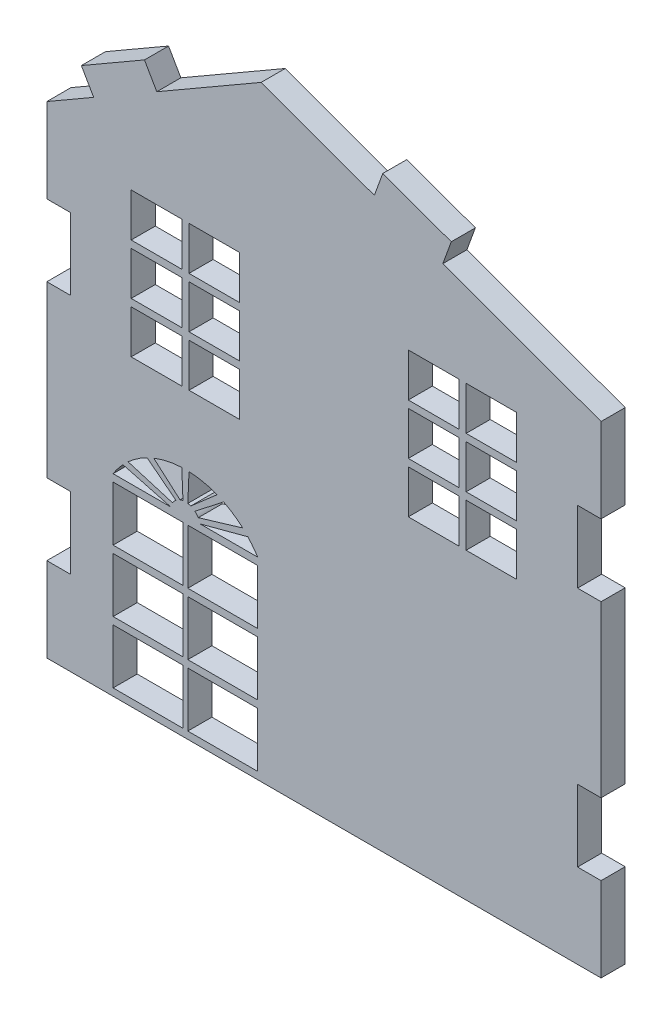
from build123d import *

# Parameters (mm, degrees)
SKETCH1_W           = 28.994596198
SKETCH1_H           = 22.666666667
SKETCH1_W_2         = 21
SKETCH1_H_2         = 18
SKETCH1_H_3         = 22.666666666
BOSS_EXTRUDE1_DEPTH = 10


with BuildPart() as part:
    # Sketch1 → Boss-Extrude1 (new body)
    with BuildSketch(Plane.XY):
        Polygon((0, 0), (-142.5, 0), (-202.5, 0), (-230, 0), (-230, 35), (-220.24, 35), (-220.24, 64.76), (-230, 64.76), (-230, 135.24), (-220.24, 135.24), (-220.24, 165), (-230, 165), (-230, 200), (-210.558262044, 211.224692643), (-215.678262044, 220.092792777), (-189.489653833, 235.212792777), (-184.369653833, 226.344692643), (-141.068383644, 251.344692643), (-94.083752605, 234.243685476), (-90.581466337, 243.866137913), (-62.165161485, 233.523448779), (-65.667447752, 223.900996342), (0, 200), (0, 165), (-9.76, 165), (-9.76, 135.24), (0, 135.24), (0, 64.76), (-9.76, 64.76), (-9.76, 35), (0, 35), align=None)
        with BuildLine():
            Line((-202.5, 80), (-178.572985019, 80))
            Line((-178.572985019, 80), (-198.419387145, 85.283992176))
            ThreePointArc((-198.419387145, 85.283992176), (-200.584241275, 82.738179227), (-202.5, 80))
        make_face(mode=Mode.SUBTRACT)
        with Locations((-188.002701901, 14.333333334)):
            Rectangle(SKETCH1_W, SKETCH1_H, mode=Mode.SUBTRACT)
        with Locations((-156.997298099, 14.333333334)):
            Rectangle(SKETCH1_W, SKETCH1_H, mode=Mode.SUBTRACT)
        with Locations((-184.5, 176.734387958)):
            Rectangle(SKETCH1_W_2, SKETCH1_H_2, mode=Mode.SUBTRACT)
        with Locations((-184.5, 134.734387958)):
            Rectangle(SKETCH1_W_2, SKETCH1_H_2, mode=Mode.SUBTRACT)
        with Locations((-160.5, 176.734387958)):
            Rectangle(SKETCH1_W_2, SKETCH1_H_2, mode=Mode.SUBTRACT)
        with Locations((-184.5, 155.734387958)):
            Rectangle(SKETCH1_W_2, SKETCH1_H_2, mode=Mode.SUBTRACT)
        with Locations((-188.002701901, 65.666666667)):
            Rectangle(SKETCH1_W, SKETCH1_H, mode=Mode.SUBTRACT)
        with BuildLine():
            Line((-196.279700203, 87.386785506), (-177.84096385, 81.861221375))
            ThreePointArc((-177.84096385, 81.861221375), (-177.216606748, 82.730951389), (-176.452214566, 83.480589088))
            Line((-176.452214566, 83.480589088), (-188.378537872, 92.78280515))
            ThreePointArc((-188.378537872, 92.78280515), (-192.511826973, 90.352326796), (-196.279700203, 87.386785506))
        make_face(mode=Mode.SUBTRACT)
        with BuildLine():
            Line((-148.720299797, 87.386785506), (-167.15903615, 81.861221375))
            ThreePointArc((-167.15903615, 81.861221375), (-167.783393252, 82.730951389), (-168.547785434, 83.480589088))
            Line((-168.547785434, 83.480589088), (-156.621462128, 92.78280515))
            ThreePointArc((-156.621462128, 92.78280515), (-152.488173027, 90.352326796), (-148.720299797, 87.386785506))
        make_face(mode=Mode.SUBTRACT)
        with BuildLine():
            Line((-166.427014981, 80), (-146.580612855, 85.283992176))
            ThreePointArc((-146.580612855, 85.283992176), (-144.415758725, 82.738179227), (-142.5, 80))
            Line((-142.5, 80), (-166.427014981, 80))
        make_face(mode=Mode.SUBTRACT)
        with BuildLine():
            Line((-185.641313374, 94.010649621), (-174.72432981, 84.487770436))
            ThreePointArc((-174.72432981, 84.487770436), (-174.123378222, 84.683736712), (-173.505626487, 84.817633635))
            Line((-173.505626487, 84.817633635), (-174, 96.502049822))
            ThreePointArc((-174, 96.502049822), (-179.925886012, 95.748044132), (-185.641313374, 94.010649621))
        make_face(mode=Mode.SUBTRACT)
        with BuildLine():
            Line((-171, 96.502049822), (-171.494373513, 84.817633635))
            ThreePointArc((-171.494373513, 84.817633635), (-170.876621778, 84.683736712), (-170.27567019, 84.487770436))
            Line((-170.27567019, 84.487770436), (-159.358686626, 94.010649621))
            ThreePointArc((-159.358686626, 94.010649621), (-165.074113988, 95.748044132), (-171, 96.502049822))
        make_face(mode=Mode.SUBTRACT)
        with Locations((-188.002701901, 40)):
            Rectangle(SKETCH1_W, SKETCH1_H_3, mode=Mode.SUBTRACT)
        with Locations((-156.997298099, 40)):
            Rectangle(SKETCH1_W, SKETCH1_H_3, mode=Mode.SUBTRACT)
        with Locations((-156.997298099, 65.666666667)):
            Rectangle(SKETCH1_W, SKETCH1_H, mode=Mode.SUBTRACT)
        with Locations((-160.5, 134.734387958)):
            Rectangle(SKETCH1_W_2, SKETCH1_H_2, mode=Mode.SUBTRACT)
        with Locations((-160.5, 155.734387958)):
            Rectangle(SKETCH1_W_2, SKETCH1_H_2, mode=Mode.SUBTRACT)
        with Locations((-69.5, 134.734387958)):
            Rectangle(SKETCH1_W_2, SKETCH1_H_2, mode=Mode.SUBTRACT)
        with Locations((-69.5, 155.734387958)):
            Rectangle(SKETCH1_W_2, SKETCH1_H_2, mode=Mode.SUBTRACT)
        with Locations((-69.5, 176.734387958)):
            Rectangle(SKETCH1_W_2, SKETCH1_H_2, mode=Mode.SUBTRACT)
        with Locations((-45.5, 134.734387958)):
            Rectangle(SKETCH1_W_2, SKETCH1_H_2, mode=Mode.SUBTRACT)
        with Locations((-45.5, 155.734387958)):
            Rectangle(SKETCH1_W_2, SKETCH1_H_2, mode=Mode.SUBTRACT)
        with Locations((-45.5, 176.734387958)):
            Rectangle(SKETCH1_W_2, SKETCH1_H_2, mode=Mode.SUBTRACT)
    extrude(amount=BOSS_EXTRUDE1_DEPTH)


solid = part.part
